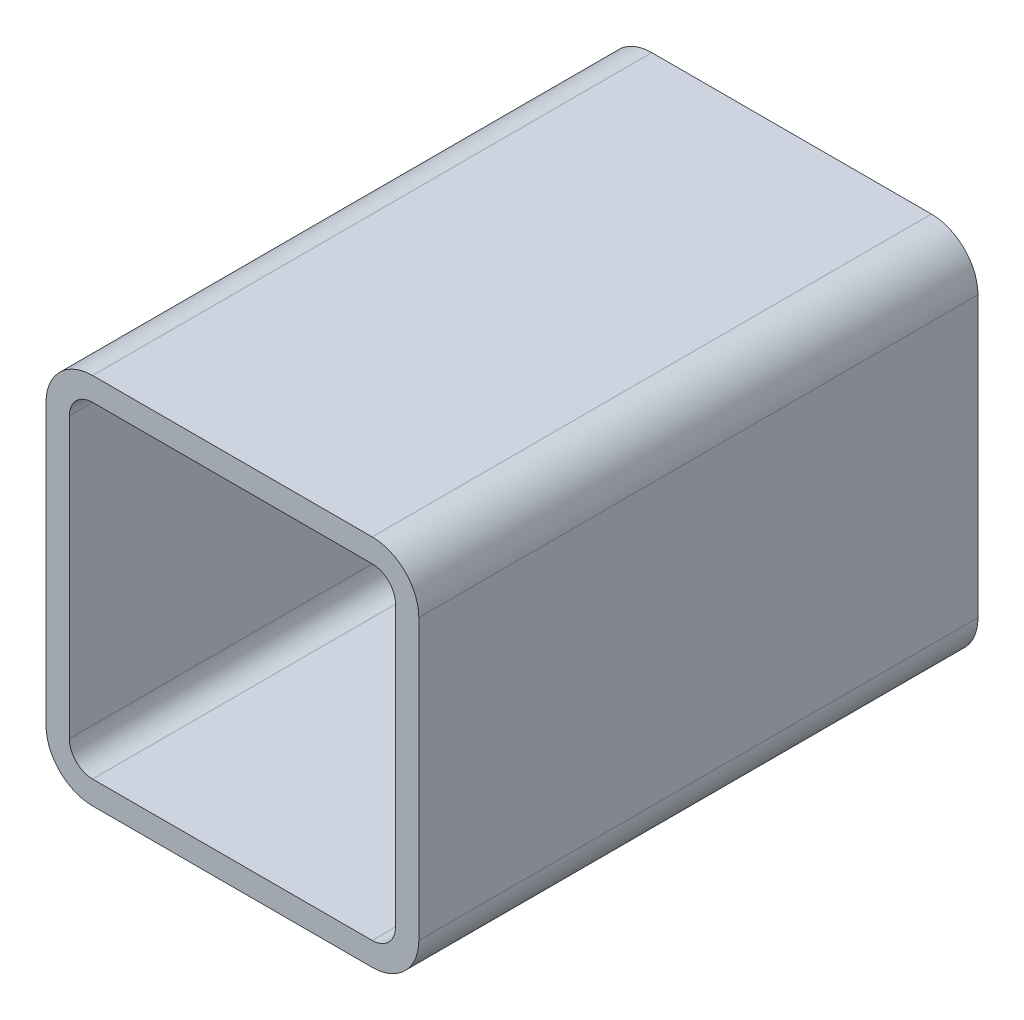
ISO-10303-21;
HEADER;
FILE_DESCRIPTION(('STEP AP214'),'2;1');
FILE_NAME('part.step','',(''),(''),'','','');
FILE_SCHEMA(('AUTOMOTIVE_DESIGN { 1 0 10303 214 1 1 1 1 }'));
ENDSEC;
DATA;
#1=APPLICATION_CONTEXT('core data for automotive mechanical design processes');
#2=APPLICATION_PROTOCOL_DEFINITION('international standard','automotive_design',2000,#1);
#3=PRODUCT_CONTEXT('',#1,'mechanical');
#4=PRODUCT('Part','Part','',(#3));
#5=PRODUCT_RELATED_PRODUCT_CATEGORY('part','',(#4));
#6=PRODUCT_DEFINITION_FORMATION('','',#4);
#7=PRODUCT_DEFINITION_CONTEXT('part definition',#1,'design');
#8=PRODUCT_DEFINITION('design','',#6,#7);
#9=PRODUCT_DEFINITION_SHAPE('','',#8);
#10=(LENGTH_UNIT() NAMED_UNIT(*) SI_UNIT(.MILLI.,.METRE.));
#11=(NAMED_UNIT(*) PLANE_ANGLE_UNIT() SI_UNIT($,.RADIAN.));
#12=(NAMED_UNIT(*) SI_UNIT($,.STERADIAN.) SOLID_ANGLE_UNIT());
#13=UNCERTAINTY_MEASURE_WITH_UNIT(LENGTH_MEASURE(1.E-05),#10,'distance_accuracy_value','');
#14=(GEOMETRIC_REPRESENTATION_CONTEXT(3) GLOBAL_UNCERTAINTY_ASSIGNED_CONTEXT((#13)) GLOBAL_UNIT_ASSIGNED_CONTEXT((#10,
#11,#12)) REPRESENTATION_CONTEXT('',''));
#15=CARTESIAN_POINT('',(0.,0.,0.));
#16=DIRECTION('',(0.,0.,1.));
#17=DIRECTION('',(1.,0.,0.));
#18=AXIS2_PLACEMENT_3D('',#15,#16,#17);
#19=CARTESIAN_POINT('',(26.7909404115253,179.766130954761,304.8));
#20=DIRECTION('',(0.,0.,1.));
#21=DIRECTION('',(1.,0.,0.));
#22=AXIS2_PLACEMENT_3D('',#19,#20,#21);
#23=PLANE('',#22);
#24=CARTESIAN_POINT('',(26.7909404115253,179.766130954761,304.8));
#25=DIRECTION('',(0.,0.,1.));
#26=DIRECTION('',(1.,0.,0.));
#27=AXIS2_PLACEMENT_3D('',#24,#25,#26);
#28=CIRCLE('',#27,25.4);
#29=CARTESIAN_POINT('',(26.7909404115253,205.166130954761,304.8));
#30=VERTEX_POINT('',#29);
#31=CARTESIAN_POINT('',(1.3909404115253,179.766130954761,304.8));
#32=VERTEX_POINT('',#31);
#33=EDGE_CURVE('E211',#30,#32,#28,.T.);
#34=ORIENTED_EDGE('',*,*,#33,.T.);
#35=DIRECTION('',(0.,-1.,0.));
#36=VECTOR('',#35,1.);
#37=CARTESIAN_POINT('',(1.3909404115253,27.3661309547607,304.8));
#38=LINE('',#37,#36);
#39=CARTESIAN_POINT('',(1.3909404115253,27.3661309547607,304.8));
#40=VERTEX_POINT('',#39);
#41=EDGE_CURVE('E214',#32,#40,#38,.T.);
#42=ORIENTED_EDGE('',*,*,#41,.T.);
#43=CARTESIAN_POINT('',(26.7909404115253,27.3661309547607,304.8));
#44=DIRECTION('',(0.,0.,1.));
#45=DIRECTION('',(1.,0.,0.));
#46=AXIS2_PLACEMENT_3D('',#43,#44,#45);
#47=CIRCLE('',#46,25.4);
#48=CARTESIAN_POINT('',(26.7909404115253,1.96613095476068,304.8));
#49=VERTEX_POINT('',#48);
#50=EDGE_CURVE('E217',#40,#49,#47,.T.);
#51=ORIENTED_EDGE('',*,*,#50,.T.);
#52=DIRECTION('',(1.,0.,0.));
#53=VECTOR('',#52,1.);
#54=CARTESIAN_POINT('',(179.190940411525,1.96613095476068,304.8));
#55=LINE('',#54,#53);
#56=CARTESIAN_POINT('',(179.190940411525,1.96613095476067,304.8));
#57=VERTEX_POINT('',#56);
#58=EDGE_CURVE('E219',#49,#57,#55,.T.);
#59=ORIENTED_EDGE('',*,*,#58,.T.);
#60=CARTESIAN_POINT('',(179.190940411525,27.3661309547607,304.8));
#61=DIRECTION('',(0.,0.,1.));
#62=DIRECTION('',(1.,0.,0.));
#63=AXIS2_PLACEMENT_3D('',#60,#61,#62);
#64=CIRCLE('',#63,25.4);
#65=CARTESIAN_POINT('',(204.590940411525,27.3661309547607,304.8));
#66=VERTEX_POINT('',#65);
#67=EDGE_CURVE('E221',#57,#66,#64,.T.);
#68=ORIENTED_EDGE('',*,*,#67,.T.);
#69=DIRECTION('',(0.,1.,0.));
#70=VECTOR('',#69,1.);
#71=CARTESIAN_POINT('',(204.590940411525,179.766130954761,304.8));
#72=LINE('',#71,#70);
#73=CARTESIAN_POINT('',(204.590940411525,179.766130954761,304.8));
#74=VERTEX_POINT('',#73);
#75=EDGE_CURVE('E223',#66,#74,#72,.T.);
#76=ORIENTED_EDGE('',*,*,#75,.T.);
#77=CARTESIAN_POINT('',(179.190940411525,179.766130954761,304.8));
#78=DIRECTION('',(0.,0.,1.));
#79=DIRECTION('',(1.,0.,0.));
#80=AXIS2_PLACEMENT_3D('',#77,#78,#79);
#81=CIRCLE('',#80,25.4);
#82=CARTESIAN_POINT('',(179.190940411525,205.166130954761,304.8));
#83=VERTEX_POINT('',#82);
#84=EDGE_CURVE('E225',#74,#83,#81,.T.);
#85=ORIENTED_EDGE('',*,*,#84,.T.);
#86=DIRECTION('',(-1.,0.,0.));
#87=VECTOR('',#86,1.);
#88=CARTESIAN_POINT('',(26.7909404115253,205.166130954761,304.8));
#89=LINE('',#88,#87);
#90=EDGE_CURVE('E227',#83,#30,#89,.T.);
#91=ORIENTED_EDGE('',*,*,#90,.T.);
#92=EDGE_LOOP('',(#34,#42,#51,#59,#68,#76,#85,#91));
#93=FACE_BOUND('',#92,.T.);
#94=DIRECTION('',(0.,-1.,0.));
#95=VECTOR('',#94,1.);
#96=CARTESIAN_POINT('',(14.0909404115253,27.3661309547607,304.8));
#97=LINE('',#96,#95);
#98=CARTESIAN_POINT('',(14.0909404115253,179.766130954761,304.8));
#99=VERTEX_POINT('',#98);
#100=CARTESIAN_POINT('',(14.0909404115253,27.3661309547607,304.8));
#101=VERTEX_POINT('',#100);
#102=EDGE_CURVE('E154',#99,#101,#97,.T.);
#103=ORIENTED_EDGE('',*,*,#102,.F.);
#104=CARTESIAN_POINT('',(26.7909404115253,179.766130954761,304.8));
#105=DIRECTION('',(0.,0.,1.));
#106=DIRECTION('',(1.,0.,0.));
#107=AXIS2_PLACEMENT_3D('',#104,#105,#106);
#108=CIRCLE('',#107,12.7);
#109=CARTESIAN_POINT('',(26.7909404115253,192.466130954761,304.8));
#110=VERTEX_POINT('',#109);
#111=EDGE_CURVE('E146',#110,#99,#108,.T.);
#112=ORIENTED_EDGE('',*,*,#111,.F.);
#113=DIRECTION('',(-1.,0.,0.));
#114=VECTOR('',#113,1.);
#115=CARTESIAN_POINT('',(26.7909404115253,192.466130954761,304.8));
#116=LINE('',#115,#114);
#117=CARTESIAN_POINT('',(179.190940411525,192.466130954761,304.8));
#118=VERTEX_POINT('',#117);
#119=EDGE_CURVE('E179',#118,#110,#116,.T.);
#120=ORIENTED_EDGE('',*,*,#119,.F.);
#121=CARTESIAN_POINT('',(179.190940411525,179.766130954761,304.8));
#122=DIRECTION('',(0.,0.,1.));
#123=DIRECTION('',(1.,0.,0.));
#124=AXIS2_PLACEMENT_3D('',#121,#122,#123);
#125=CIRCLE('',#124,12.7);
#126=CARTESIAN_POINT('',(191.890940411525,179.766130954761,304.8));
#127=VERTEX_POINT('',#126);
#128=EDGE_CURVE('E177',#127,#118,#125,.T.);
#129=ORIENTED_EDGE('',*,*,#128,.F.);
#130=DIRECTION('',(0.,1.,0.));
#131=VECTOR('',#130,1.);
#132=CARTESIAN_POINT('',(191.890940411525,179.766130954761,304.8));
#133=LINE('',#132,#131);
#134=CARTESIAN_POINT('',(191.890940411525,27.3661309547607,304.8));
#135=VERTEX_POINT('',#134);
#136=EDGE_CURVE('E175',#135,#127,#133,.T.);
#137=ORIENTED_EDGE('',*,*,#136,.F.);
#138=CARTESIAN_POINT('',(179.190940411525,27.3661309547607,304.8));
#139=DIRECTION('',(0.,0.,1.));
#140=DIRECTION('',(1.,0.,0.));
#141=AXIS2_PLACEMENT_3D('',#138,#139,#140);
#142=CIRCLE('',#141,12.7);
#143=CARTESIAN_POINT('',(179.190940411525,14.6661309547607,304.8));
#144=VERTEX_POINT('',#143);
#145=EDGE_CURVE('E173',#144,#135,#142,.T.);
#146=ORIENTED_EDGE('',*,*,#145,.F.);
#147=DIRECTION('',(1.,0.,0.));
#148=VECTOR('',#147,1.);
#149=CARTESIAN_POINT('',(179.190940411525,14.6661309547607,304.8));
#150=LINE('',#149,#148);
#151=CARTESIAN_POINT('',(26.7909404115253,14.6661309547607,304.8));
#152=VERTEX_POINT('',#151);
#153=EDGE_CURVE('E169',#152,#144,#150,.T.);
#154=ORIENTED_EDGE('',*,*,#153,.F.);
#155=CARTESIAN_POINT('',(26.7909404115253,27.3661309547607,304.8));
#156=DIRECTION('',(0.,0.,1.));
#157=DIRECTION('',(1.,0.,0.));
#158=AXIS2_PLACEMENT_3D('',#155,#156,#157);
#159=CIRCLE('',#158,12.7);
#160=EDGE_CURVE('E167',#101,#152,#159,.T.);
#161=ORIENTED_EDGE('',*,*,#160,.F.);
#162=EDGE_LOOP('',(#103,#112,#120,#129,#137,#146,#154,#161));
#163=FACE_BOUND('',#162,.T.);
#164=ADVANCED_FACE('F33',(#93,#163),#23,.T.);
#165=CARTESIAN_POINT('',(26.7909404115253,179.766130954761,0.));
#166=DIRECTION('',(0.,0.,1.));
#167=DIRECTION('',(1.,0.,0.));
#168=AXIS2_PLACEMENT_3D('',#165,#166,#167);
#169=PLANE('',#168);
#170=CARTESIAN_POINT('',(26.7909404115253,179.766130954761,0.));
#171=DIRECTION('',(0.,0.,1.));
#172=DIRECTION('',(1.,0.,0.));
#173=AXIS2_PLACEMENT_3D('',#170,#171,#172);
#174=CIRCLE('',#173,25.4);
#175=CARTESIAN_POINT('',(26.7909404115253,205.166130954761,0.));
#176=VERTEX_POINT('',#175);
#177=CARTESIAN_POINT('',(1.3909404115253,179.766130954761,0.));
#178=VERTEX_POINT('',#177);
#179=EDGE_CURVE('E162',#176,#178,#174,.T.);
#180=ORIENTED_EDGE('',*,*,#179,.F.);
#181=DIRECTION('',(-1.,0.,0.));
#182=VECTOR('',#181,1.);
#183=CARTESIAN_POINT('',(26.7909404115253,205.166130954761,0.));
#184=LINE('',#183,#182);
#185=CARTESIAN_POINT('',(179.190940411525,205.166130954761,0.));
#186=VERTEX_POINT('',#185);
#187=EDGE_CURVE('E215',#186,#176,#184,.T.);
#188=ORIENTED_EDGE('',*,*,#187,.F.);
#189=CARTESIAN_POINT('',(179.190940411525,179.766130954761,0.));
#190=DIRECTION('',(0.,0.,1.));
#191=DIRECTION('',(1.,0.,0.));
#192=AXIS2_PLACEMENT_3D('',#189,#190,#191);
#193=CIRCLE('',#192,25.4);
#194=CARTESIAN_POINT('',(204.590940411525,179.766130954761,0.));
#195=VERTEX_POINT('',#194);
#196=EDGE_CURVE('E242',#195,#186,#193,.T.);
#197=ORIENTED_EDGE('',*,*,#196,.F.);
#198=DIRECTION('',(0.,1.,0.));
#199=VECTOR('',#198,1.);
#200=CARTESIAN_POINT('',(204.590940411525,179.766130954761,0.));
#201=LINE('',#200,#199);
#202=CARTESIAN_POINT('',(204.590940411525,27.3661309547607,0.));
#203=VERTEX_POINT('',#202);
#204=EDGE_CURVE('E240',#203,#195,#201,.T.);
#205=ORIENTED_EDGE('',*,*,#204,.F.);
#206=CARTESIAN_POINT('',(179.190940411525,27.3661309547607,0.));
#207=DIRECTION('',(0.,0.,1.));
#208=DIRECTION('',(1.,0.,0.));
#209=AXIS2_PLACEMENT_3D('',#206,#207,#208);
#210=CIRCLE('',#209,25.4);
#211=CARTESIAN_POINT('',(179.190940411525,1.96613095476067,0.));
#212=VERTEX_POINT('',#211);
#213=EDGE_CURVE('E238',#212,#203,#210,.T.);
#214=ORIENTED_EDGE('',*,*,#213,.F.);
#215=DIRECTION('',(1.,0.,0.));
#216=VECTOR('',#215,1.);
#217=CARTESIAN_POINT('',(179.190940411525,1.96613095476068,0.));
#218=LINE('',#217,#216);
#219=CARTESIAN_POINT('',(26.7909404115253,1.96613095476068,0.));
#220=VERTEX_POINT('',#219);
#221=EDGE_CURVE('E236',#220,#212,#218,.T.);
#222=ORIENTED_EDGE('',*,*,#221,.F.);
#223=CARTESIAN_POINT('',(26.7909404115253,27.3661309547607,0.));
#224=DIRECTION('',(0.,0.,1.));
#225=DIRECTION('',(1.,0.,0.));
#226=AXIS2_PLACEMENT_3D('',#223,#224,#225);
#227=CIRCLE('',#226,25.4);
#228=CARTESIAN_POINT('',(1.3909404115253,27.3661309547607,0.));
#229=VERTEX_POINT('',#228);
#230=EDGE_CURVE('E234',#229,#220,#227,.T.);
#231=ORIENTED_EDGE('',*,*,#230,.F.);
#232=DIRECTION('',(0.,-1.,0.));
#233=VECTOR('',#232,1.);
#234=CARTESIAN_POINT('',(1.3909404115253,27.3661309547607,0.));
#235=LINE('',#234,#233);
#236=EDGE_CURVE('E232',#178,#229,#235,.T.);
#237=ORIENTED_EDGE('',*,*,#236,.F.);
#238=EDGE_LOOP('',(#180,#188,#197,#205,#214,#222,#231,#237));
#239=FACE_BOUND('',#238,.T.);
#240=CARTESIAN_POINT('',(26.7909404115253,179.766130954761,0.));
#241=DIRECTION('',(0.,0.,1.));
#242=DIRECTION('',(1.,0.,0.));
#243=AXIS2_PLACEMENT_3D('',#240,#241,#242);
#244=CIRCLE('',#243,12.7);
#245=CARTESIAN_POINT('',(26.7909404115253,192.466130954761,0.));
#246=VERTEX_POINT('',#245);
#247=CARTESIAN_POINT('',(14.0909404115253,179.766130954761,0.));
#248=VERTEX_POINT('',#247);
#249=EDGE_CURVE('E56',#246,#248,#244,.T.);
#250=ORIENTED_EDGE('',*,*,#249,.T.);
#251=DIRECTION('',(0.,-1.,0.));
#252=VECTOR('',#251,1.);
#253=CARTESIAN_POINT('',(14.0909404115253,27.3661309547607,0.));
#254=LINE('',#253,#252);
#255=CARTESIAN_POINT('',(14.0909404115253,27.3661309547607,0.));
#256=VERTEX_POINT('',#255);
#257=EDGE_CURVE('E161',#248,#256,#254,.T.);
#258=ORIENTED_EDGE('',*,*,#257,.T.);
#259=CARTESIAN_POINT('',(26.7909404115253,27.3661309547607,0.));
#260=DIRECTION('',(0.,0.,1.));
#261=DIRECTION('',(1.,0.,0.));
#262=AXIS2_PLACEMENT_3D('',#259,#260,#261);
#263=CIRCLE('',#262,12.7);
#264=CARTESIAN_POINT('',(26.7909404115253,14.6661309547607,0.));
#265=VERTEX_POINT('',#264);
#266=EDGE_CURVE('E183',#256,#265,#263,.T.);
#267=ORIENTED_EDGE('',*,*,#266,.T.);
#268=DIRECTION('',(1.,0.,0.));
#269=VECTOR('',#268,1.);
#270=CARTESIAN_POINT('',(179.190940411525,14.6661309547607,0.));
#271=LINE('',#270,#269);
#272=CARTESIAN_POINT('',(179.190940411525,14.6661309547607,0.));
#273=VERTEX_POINT('',#272);
#274=EDGE_CURVE('E186',#265,#273,#271,.T.);
#275=ORIENTED_EDGE('',*,*,#274,.T.);
#276=CARTESIAN_POINT('',(179.190940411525,27.3661309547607,0.));
#277=DIRECTION('',(0.,0.,1.));
#278=DIRECTION('',(1.,0.,0.));
#279=AXIS2_PLACEMENT_3D('',#276,#277,#278);
#280=CIRCLE('',#279,12.7);
#281=CARTESIAN_POINT('',(191.890940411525,27.3661309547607,0.));
#282=VERTEX_POINT('',#281);
#283=EDGE_CURVE('E189',#273,#282,#280,.T.);
#284=ORIENTED_EDGE('',*,*,#283,.T.);
#285=DIRECTION('',(0.,1.,0.));
#286=VECTOR('',#285,1.);
#287=CARTESIAN_POINT('',(191.890940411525,179.766130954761,0.));
#288=LINE('',#287,#286);
#289=CARTESIAN_POINT('',(191.890940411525,179.766130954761,0.));
#290=VERTEX_POINT('',#289);
#291=EDGE_CURVE('E192',#282,#290,#288,.T.);
#292=ORIENTED_EDGE('',*,*,#291,.T.);
#293=CARTESIAN_POINT('',(179.190940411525,179.766130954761,0.));
#294=DIRECTION('',(0.,0.,1.));
#295=DIRECTION('',(1.,0.,0.));
#296=AXIS2_PLACEMENT_3D('',#293,#294,#295);
#297=CIRCLE('',#296,12.7);
#298=CARTESIAN_POINT('',(179.190940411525,192.466130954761,0.));
#299=VERTEX_POINT('',#298);
#300=EDGE_CURVE('E195',#290,#299,#297,.T.);
#301=ORIENTED_EDGE('',*,*,#300,.T.);
#302=DIRECTION('',(-1.,0.,0.));
#303=VECTOR('',#302,1.);
#304=CARTESIAN_POINT('',(26.7909404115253,192.466130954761,0.));
#305=LINE('',#304,#303);
#306=EDGE_CURVE('E155',#299,#246,#305,.T.);
#307=ORIENTED_EDGE('',*,*,#306,.T.);
#308=EDGE_LOOP('',(#250,#258,#267,#275,#284,#292,#301,#307));
#309=FACE_BOUND('',#308,.T.);
#310=ADVANCED_FACE('F272',(#239,#309),#169,.F.);
#311=CARTESIAN_POINT('',(26.7909404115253,179.766130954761,304.8));
#312=DIRECTION('',(0.,0.,-1.));
#313=DIRECTION('',(-1.,0.,0.));
#314=AXIS2_PLACEMENT_3D('',#311,#312,#313);
#315=CYLINDRICAL_SURFACE('',#314,25.4);
#316=ORIENTED_EDGE('',*,*,#179,.T.);
#317=DIRECTION('',(0.,0.,-1.));
#318=VECTOR('',#317,1.);
#319=CARTESIAN_POINT('',(1.3909404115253,179.766130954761,304.8));
#320=LINE('',#319,#318);
#321=EDGE_CURVE('E11',#32,#178,#320,.T.);
#322=ORIENTED_EDGE('',*,*,#321,.F.);
#323=ORIENTED_EDGE('',*,*,#33,.F.);
#324=DIRECTION('',(0.,0.,-1.));
#325=VECTOR('',#324,1.);
#326=CARTESIAN_POINT('',(26.7909404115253,205.166130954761,304.8));
#327=LINE('',#326,#325);
#328=EDGE_CURVE('E229',#30,#176,#327,.T.);
#329=ORIENTED_EDGE('',*,*,#328,.T.);
#330=EDGE_LOOP('',(#316,#322,#323,#329));
#331=FACE_BOUND('',#330,.T.);
#332=ADVANCED_FACE('F35',(#331),#315,.T.);
#333=CARTESIAN_POINT('',(1.3909404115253,27.3661309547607,304.8));
#334=DIRECTION('',(1.,0.,0.));
#335=DIRECTION('',(0.,0.,-1.));
#336=AXIS2_PLACEMENT_3D('',#333,#334,#335);
#337=PLANE('',#336);
#338=ORIENTED_EDGE('',*,*,#236,.T.);
#339=DIRECTION('',(0.,0.,-1.));
#340=VECTOR('',#339,1.);
#341=CARTESIAN_POINT('',(1.3909404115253,27.3661309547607,304.8));
#342=LINE('',#341,#340);
#343=EDGE_CURVE('E41',#40,#229,#342,.T.);
#344=ORIENTED_EDGE('',*,*,#343,.F.);
#345=ORIENTED_EDGE('',*,*,#41,.F.);
#346=ORIENTED_EDGE('',*,*,#321,.T.);
#347=EDGE_LOOP('',(#338,#344,#345,#346));
#348=FACE_BOUND('',#347,.T.);
#349=ADVANCED_FACE('F289',(#348),#337,.F.);
#350=CARTESIAN_POINT('',(26.7909404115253,27.3661309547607,304.8));
#351=DIRECTION('',(0.,0.,-1.));
#352=DIRECTION('',(-1.,0.,0.));
#353=AXIS2_PLACEMENT_3D('',#350,#351,#352);
#354=CYLINDRICAL_SURFACE('',#353,25.4);
#355=ORIENTED_EDGE('',*,*,#230,.T.);
#356=DIRECTION('',(0.,0.,-1.));
#357=VECTOR('',#356,1.);
#358=CARTESIAN_POINT('',(26.7909404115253,1.96613095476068,304.8));
#359=LINE('',#358,#357);
#360=EDGE_CURVE('E259',#49,#220,#359,.T.);
#361=ORIENTED_EDGE('',*,*,#360,.F.);
#362=ORIENTED_EDGE('',*,*,#50,.F.);
#363=ORIENTED_EDGE('',*,*,#343,.T.);
#364=EDGE_LOOP('',(#355,#361,#362,#363));
#365=FACE_BOUND('',#364,.T.);
#366=ADVANCED_FACE('F266',(#365),#354,.T.);
#367=CARTESIAN_POINT('',(179.190940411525,1.96613095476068,304.8));
#368=DIRECTION('',(0.,1.,0.));
#369=DIRECTION('',(0.,0.,1.));
#370=AXIS2_PLACEMENT_3D('',#367,#368,#369);
#371=PLANE('',#370);
#372=ORIENTED_EDGE('',*,*,#221,.T.);
#373=DIRECTION('',(0.,0.,-1.));
#374=VECTOR('',#373,1.);
#375=CARTESIAN_POINT('',(179.190940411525,1.96613095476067,304.8));
#376=LINE('',#375,#374);
#377=EDGE_CURVE('E256',#57,#212,#376,.T.);
#378=ORIENTED_EDGE('',*,*,#377,.F.);
#379=ORIENTED_EDGE('',*,*,#58,.F.);
#380=ORIENTED_EDGE('',*,*,#360,.T.);
#381=EDGE_LOOP('',(#372,#378,#379,#380));
#382=FACE_BOUND('',#381,.T.);
#383=ADVANCED_FACE('F278',(#382),#371,.F.);
#384=CARTESIAN_POINT('',(179.190940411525,27.3661309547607,304.8));
#385=DIRECTION('',(0.,0.,-1.));
#386=DIRECTION('',(-1.,0.,0.));
#387=AXIS2_PLACEMENT_3D('',#384,#385,#386);
#388=CYLINDRICAL_SURFACE('',#387,25.4);
#389=ORIENTED_EDGE('',*,*,#213,.T.);
#390=DIRECTION('',(0.,0.,-1.));
#391=VECTOR('',#390,1.);
#392=CARTESIAN_POINT('',(204.590940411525,27.3661309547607,304.8));
#393=LINE('',#392,#391);
#394=EDGE_CURVE('E253',#66,#203,#393,.T.);
#395=ORIENTED_EDGE('',*,*,#394,.F.);
#396=ORIENTED_EDGE('',*,*,#67,.F.);
#397=ORIENTED_EDGE('',*,*,#377,.T.);
#398=EDGE_LOOP('',(#389,#395,#396,#397));
#399=FACE_BOUND('',#398,.T.);
#400=ADVANCED_FACE('F282',(#399),#388,.T.);
#401=CARTESIAN_POINT('',(204.590940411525,179.766130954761,304.8));
#402=DIRECTION('',(-1.,0.,0.));
#403=DIRECTION('',(0.,0.,1.));
#404=AXIS2_PLACEMENT_3D('',#401,#402,#403);
#405=PLANE('',#404);
#406=ORIENTED_EDGE('',*,*,#204,.T.);
#407=DIRECTION('',(0.,0.,-1.));
#408=VECTOR('',#407,1.);
#409=CARTESIAN_POINT('',(204.590940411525,179.766130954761,304.8));
#410=LINE('',#409,#408);
#411=EDGE_CURVE('E250',#74,#195,#410,.T.);
#412=ORIENTED_EDGE('',*,*,#411,.F.);
#413=ORIENTED_EDGE('',*,*,#75,.F.);
#414=ORIENTED_EDGE('',*,*,#394,.T.);
#415=EDGE_LOOP('',(#406,#412,#413,#414));
#416=FACE_BOUND('',#415,.T.);
#417=ADVANCED_FACE('F302',(#416),#405,.F.);
#418=CARTESIAN_POINT('',(179.190940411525,179.766130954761,304.8));
#419=DIRECTION('',(0.,0.,-1.));
#420=DIRECTION('',(-1.,0.,0.));
#421=AXIS2_PLACEMENT_3D('',#418,#419,#420);
#422=CYLINDRICAL_SURFACE('',#421,25.4);
#423=ORIENTED_EDGE('',*,*,#196,.T.);
#424=DIRECTION('',(0.,0.,-1.));
#425=VECTOR('',#424,1.);
#426=CARTESIAN_POINT('',(179.190940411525,205.166130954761,304.8));
#427=LINE('',#426,#425);
#428=EDGE_CURVE('E247',#83,#186,#427,.T.);
#429=ORIENTED_EDGE('',*,*,#428,.F.);
#430=ORIENTED_EDGE('',*,*,#84,.F.);
#431=ORIENTED_EDGE('',*,*,#411,.T.);
#432=EDGE_LOOP('',(#423,#429,#430,#431));
#433=FACE_BOUND('',#432,.T.);
#434=ADVANCED_FACE('F300',(#433),#422,.T.);
#435=CARTESIAN_POINT('',(26.7909404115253,205.166130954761,304.8));
#436=DIRECTION('',(0.,-1.,0.));
#437=DIRECTION('',(0.,0.,-1.));
#438=AXIS2_PLACEMENT_3D('',#435,#436,#437);
#439=PLANE('',#438);
#440=ORIENTED_EDGE('',*,*,#187,.T.);
#441=ORIENTED_EDGE('',*,*,#328,.F.);
#442=ORIENTED_EDGE('',*,*,#90,.F.);
#443=ORIENTED_EDGE('',*,*,#428,.T.);
#444=EDGE_LOOP('',(#440,#441,#442,#443));
#445=FACE_BOUND('',#444,.T.);
#446=ADVANCED_FACE('F295',(#445),#439,.F.);
#447=CARTESIAN_POINT('',(26.7909404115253,179.766130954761,304.8));
#448=DIRECTION('',(0.,0.,-1.));
#449=DIRECTION('',(-1.,0.,0.));
#450=AXIS2_PLACEMENT_3D('',#447,#448,#449);
#451=CYLINDRICAL_SURFACE('',#450,12.7);
#452=ORIENTED_EDGE('',*,*,#249,.F.);
#453=DIRECTION('',(0.,0.,-1.));
#454=VECTOR('',#453,1.);
#455=CARTESIAN_POINT('',(26.7909404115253,192.466130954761,304.8));
#456=LINE('',#455,#454);
#457=EDGE_CURVE('E150',#110,#246,#456,.T.);
#458=ORIENTED_EDGE('',*,*,#457,.F.);
#459=ORIENTED_EDGE('',*,*,#111,.T.);
#460=DIRECTION('',(0.,0.,-1.));
#461=VECTOR('',#460,1.);
#462=CARTESIAN_POINT('',(14.0909404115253,179.766130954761,304.8));
#463=LINE('',#462,#461);
#464=EDGE_CURVE('E149',#99,#248,#463,.T.);
#465=ORIENTED_EDGE('',*,*,#464,.T.);
#466=EDGE_LOOP('',(#452,#458,#459,#465));
#467=FACE_BOUND('',#466,.T.);
#468=ADVANCED_FACE('F148',(#467),#451,.F.);
#469=CARTESIAN_POINT('',(14.0909404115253,27.3661309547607,304.8));
#470=DIRECTION('',(1.,0.,0.));
#471=DIRECTION('',(0.,0.,-1.));
#472=AXIS2_PLACEMENT_3D('',#469,#470,#471);
#473=PLANE('',#472);
#474=ORIENTED_EDGE('',*,*,#257,.F.);
#475=ORIENTED_EDGE('',*,*,#464,.F.);
#476=ORIENTED_EDGE('',*,*,#102,.T.);
#477=DIRECTION('',(0.,0.,-1.));
#478=VECTOR('',#477,1.);
#479=CARTESIAN_POINT('',(14.0909404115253,27.3661309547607,304.8));
#480=LINE('',#479,#478);
#481=EDGE_CURVE('E163',#101,#256,#480,.T.);
#482=ORIENTED_EDGE('',*,*,#481,.T.);
#483=EDGE_LOOP('',(#474,#475,#476,#482));
#484=FACE_BOUND('',#483,.T.);
#485=ADVANCED_FACE('F158',(#484),#473,.T.);
#486=CARTESIAN_POINT('',(26.7909404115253,27.3661309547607,304.8));
#487=DIRECTION('',(0.,0.,-1.));
#488=DIRECTION('',(-1.,0.,0.));
#489=AXIS2_PLACEMENT_3D('',#486,#487,#488);
#490=CYLINDRICAL_SURFACE('',#489,12.7);
#491=ORIENTED_EDGE('',*,*,#266,.F.);
#492=ORIENTED_EDGE('',*,*,#481,.F.);
#493=ORIENTED_EDGE('',*,*,#160,.T.);
#494=DIRECTION('',(0.,0.,-1.));
#495=VECTOR('',#494,1.);
#496=CARTESIAN_POINT('',(26.7909404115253,14.6661309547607,304.8));
#497=LINE('',#496,#495);
#498=EDGE_CURVE('E208',#152,#265,#497,.T.);
#499=ORIENTED_EDGE('',*,*,#498,.T.);
#500=EDGE_LOOP('',(#491,#492,#493,#499));
#501=FACE_BOUND('',#500,.T.);
#502=ADVANCED_FACE('F327',(#501),#490,.F.);
#503=CARTESIAN_POINT('',(179.190940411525,14.6661309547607,304.8));
#504=DIRECTION('',(0.,1.,0.));
#505=DIRECTION('',(0.,0.,1.));
#506=AXIS2_PLACEMENT_3D('',#503,#504,#505);
#507=PLANE('',#506);
#508=ORIENTED_EDGE('',*,*,#274,.F.);
#509=ORIENTED_EDGE('',*,*,#498,.F.);
#510=ORIENTED_EDGE('',*,*,#153,.T.);
#511=DIRECTION('',(0.,0.,-1.));
#512=VECTOR('',#511,1.);
#513=CARTESIAN_POINT('',(179.190940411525,14.6661309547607,304.8));
#514=LINE('',#513,#512);
#515=EDGE_CURVE('E206',#144,#273,#514,.T.);
#516=ORIENTED_EDGE('',*,*,#515,.T.);
#517=EDGE_LOOP('',(#508,#509,#510,#516));
#518=FACE_BOUND('',#517,.T.);
#519=ADVANCED_FACE('F331',(#518),#507,.T.);
#520=CARTESIAN_POINT('',(179.190940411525,27.3661309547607,304.8));
#521=DIRECTION('',(0.,0.,-1.));
#522=DIRECTION('',(-1.,0.,0.));
#523=AXIS2_PLACEMENT_3D('',#520,#521,#522);
#524=CYLINDRICAL_SURFACE('',#523,12.7);
#525=ORIENTED_EDGE('',*,*,#283,.F.);
#526=ORIENTED_EDGE('',*,*,#515,.F.);
#527=ORIENTED_EDGE('',*,*,#145,.T.);
#528=DIRECTION('',(0.,0.,-1.));
#529=VECTOR('',#528,1.);
#530=CARTESIAN_POINT('',(191.890940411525,27.3661309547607,304.8));
#531=LINE('',#530,#529);
#532=EDGE_CURVE('E204',#135,#282,#531,.T.);
#533=ORIENTED_EDGE('',*,*,#532,.T.);
#534=EDGE_LOOP('',(#525,#526,#527,#533));
#535=FACE_BOUND('',#534,.T.);
#536=ADVANCED_FACE('F337',(#535),#524,.F.);
#537=CARTESIAN_POINT('',(191.890940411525,179.766130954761,304.8));
#538=DIRECTION('',(-1.,0.,0.));
#539=DIRECTION('',(0.,0.,1.));
#540=AXIS2_PLACEMENT_3D('',#537,#538,#539);
#541=PLANE('',#540);
#542=ORIENTED_EDGE('',*,*,#291,.F.);
#543=ORIENTED_EDGE('',*,*,#532,.F.);
#544=ORIENTED_EDGE('',*,*,#136,.T.);
#545=DIRECTION('',(0.,0.,-1.));
#546=VECTOR('',#545,1.);
#547=CARTESIAN_POINT('',(191.890940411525,179.766130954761,304.8));
#548=LINE('',#547,#546);
#549=EDGE_CURVE('E202',#127,#290,#548,.T.);
#550=ORIENTED_EDGE('',*,*,#549,.T.);
#551=EDGE_LOOP('',(#542,#543,#544,#550));
#552=FACE_BOUND('',#551,.T.);
#553=ADVANCED_FACE('F341',(#552),#541,.T.);
#554=CARTESIAN_POINT('',(179.190940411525,179.766130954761,304.8));
#555=DIRECTION('',(0.,0.,-1.));
#556=DIRECTION('',(-1.,0.,0.));
#557=AXIS2_PLACEMENT_3D('',#554,#555,#556);
#558=CYLINDRICAL_SURFACE('',#557,12.7);
#559=ORIENTED_EDGE('',*,*,#300,.F.);
#560=ORIENTED_EDGE('',*,*,#549,.F.);
#561=ORIENTED_EDGE('',*,*,#128,.T.);
#562=DIRECTION('',(0.,0.,-1.));
#563=VECTOR('',#562,1.);
#564=CARTESIAN_POINT('',(179.190940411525,192.466130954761,304.8));
#565=LINE('',#564,#563);
#566=EDGE_CURVE('E48',#118,#299,#565,.T.);
#567=ORIENTED_EDGE('',*,*,#566,.T.);
#568=EDGE_LOOP('',(#559,#560,#561,#567));
#569=FACE_BOUND('',#568,.T.);
#570=ADVANCED_FACE('F345',(#569),#558,.F.);
#571=CARTESIAN_POINT('',(26.7909404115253,192.466130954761,304.8));
#572=DIRECTION('',(0.,-1.,0.));
#573=DIRECTION('',(0.,0.,-1.));
#574=AXIS2_PLACEMENT_3D('',#571,#572,#573);
#575=PLANE('',#574);
#576=ORIENTED_EDGE('',*,*,#306,.F.);
#577=ORIENTED_EDGE('',*,*,#566,.F.);
#578=ORIENTED_EDGE('',*,*,#119,.T.);
#579=ORIENTED_EDGE('',*,*,#457,.T.);
#580=EDGE_LOOP('',(#576,#577,#578,#579));
#581=FACE_BOUND('',#580,.T.);
#582=ADVANCED_FACE('F349',(#581),#575,.T.);
#583=CLOSED_SHELL('',(#164,#310,#332,#349,#366,#383,#400,#417,#434,#446,#468,#485,#502,#519,
#536,#553,#570,#582));
#584=MANIFOLD_SOLID_BREP('B2',#583);
#585=ADVANCED_BREP_SHAPE_REPRESENTATION('',(#18,#584),#14);
#586=SHAPE_DEFINITION_REPRESENTATION(#9,#585);
ENDSEC;
END-ISO-10303-21;
